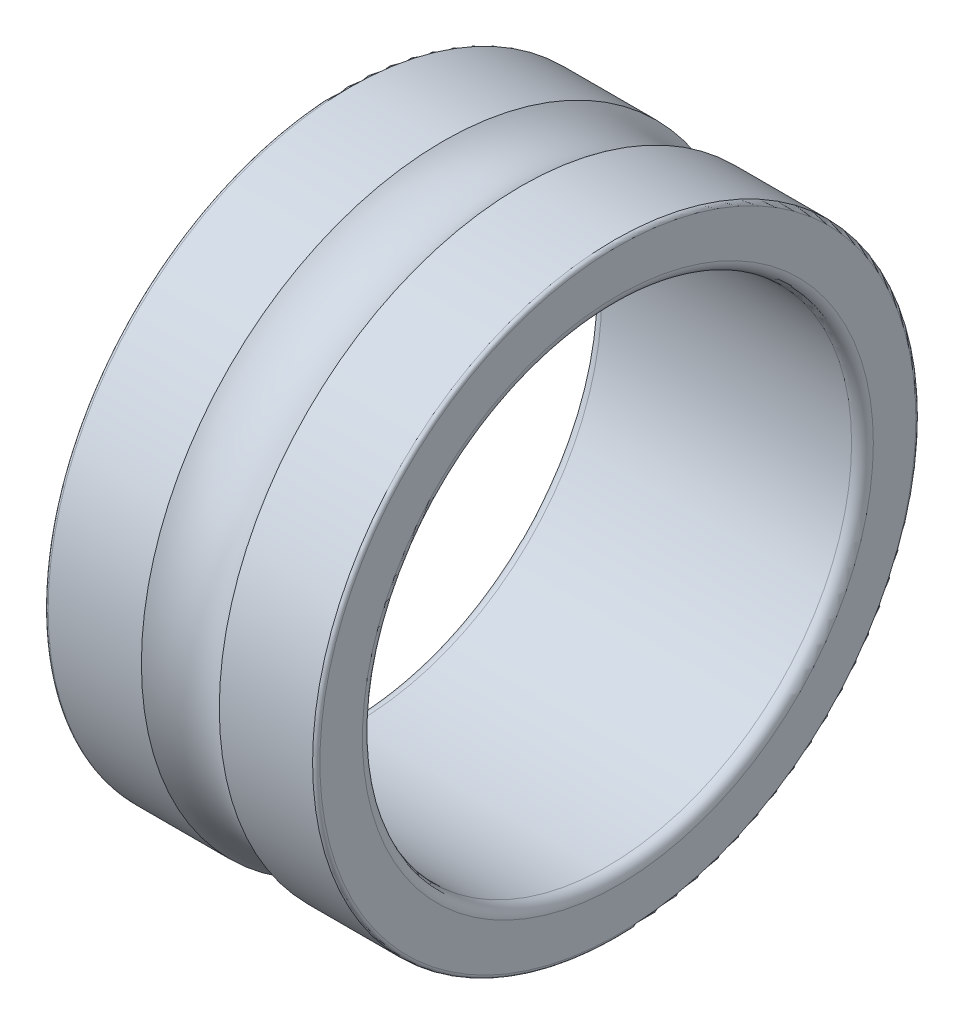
from build123d import *


with BuildPart() as part:
    # Sketch1 → Revolve1 (revolve)
    with BuildSketch(Plane.XY, mode=Mode.PRIVATE) as revolve1_sk:
        with BuildLine():
            Line((0.2, 4.5), (4.8, 4.5))
            ThreePointArc((4.8, 4.5), (4.941421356, 4.558578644), (5, 4.7))
            Line((5, 4.7), (5, 5.483))
            ThreePointArc((5, 5.483), (4.980376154, 5.530376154), (4.933, 5.55))
            Line((4.933, 5.55), (3.216658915, 5.55))
            ThreePointArc((3.216658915, 5.55), (2.5, 5.31), (1.783341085, 5.55))
            Line((1.783341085, 5.55), (0.067, 5.55))
            ThreePointArc((0.067, 5.55), (0.019623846, 5.530376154), (0, 5.483))
            Line((0, 5.483), (0, 4.7))
            ThreePointArc((0, 4.7), (0.058578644, 4.558578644), (0.2, 4.5))
        make_face()
    revolve(revolve1_sk.sketch.rotate(Axis((50, 0, 0), (-1, 0, 0)), 90), axis=Axis((50, 0, 0), (-1, 0, 0)))


solid = part.part
